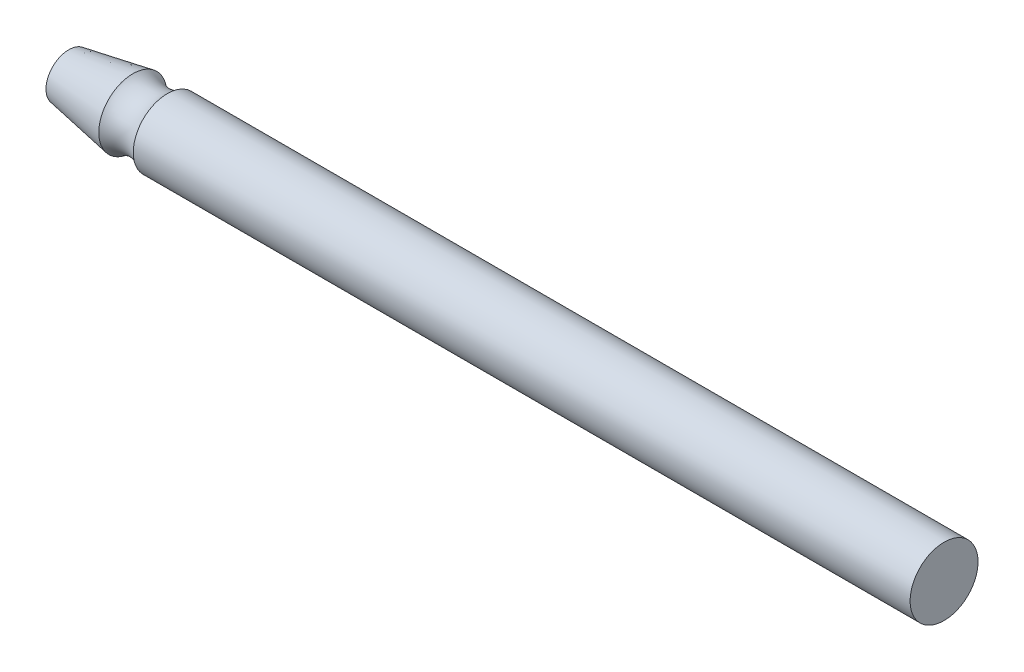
from build123d import *

# Parameters (mm, degrees)
TROU_TARAUD_M31_D           = 2.5
TROU_TARAUD_M31_DEPTH       = 18
TROU_TARAUD_M31_CSINK_D     = 3.05
TROU_TARAUD_M31_CSINK_ANGLE = 82
TROU_TARAUD_M31_TIP         = 0.751075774


with BuildPart() as part:
    # Esquisse1 → R_volution1 (revolve)
    with BuildSketch(Plane.XY, mode=Mode.PRIVATE) as r_volution1_sk:
        with BuildLine():
            Line((-45.075, 0), (45.075, 0))
            Line((45.075, 0), (45.075, 3.5))
            Line((45.075, 3.5), (-34.925, 3.5))
            ThreePointArc((-34.925, 3.5), (-36.7, 2.865496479), (-38.475, 3.5))
            Line((-38.475, 3.5), (-45.075, 2.336241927))
            Line((-45.075, 2.336241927), (-45.075, 0))
        make_face()
    revolve(r_volution1_sk.sketch.rotate(Axis((-45.075, 0, 0), (1, 0, 0)), 90), axis=Axis((-45.075, 0, 0), (1, 0, 0)))

    # Trou taraud_ M31
    with Locations(Plane.ZY.offset(45.075)):
        with Locations((0, 0)):
            CounterSinkHole(TROU_TARAUD_M31_D / 2, TROU_TARAUD_M31_CSINK_D / 2, depth=TROU_TARAUD_M31_DEPTH, counter_sink_angle=TROU_TARAUD_M31_CSINK_ANGLE)
            with Locations((0, 0, -(TROU_TARAUD_M31_DEPTH + TROU_TARAUD_M31_TIP / 2))):  # 118° drill point
                Cone(0, TROU_TARAUD_M31_D / 2, TROU_TARAUD_M31_TIP, mode=Mode.SUBTRACT)


solid = part.part
